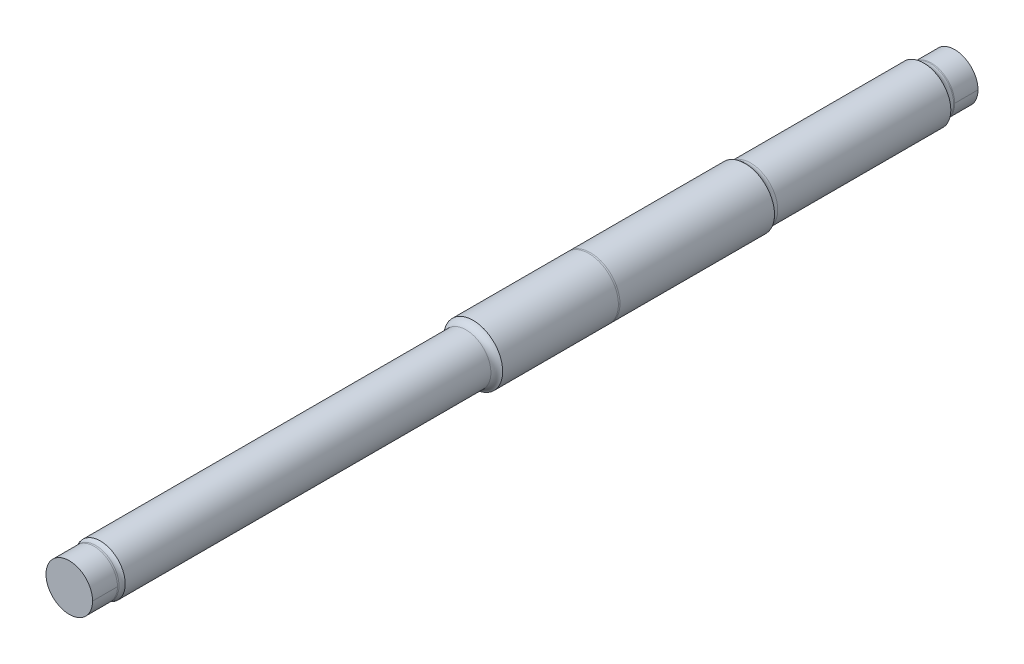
ISO-10303-21;
HEADER;
FILE_DESCRIPTION(('STEP AP214'),'2;1');
FILE_NAME('part.step','',(''),(''),'','','');
FILE_SCHEMA(('AUTOMOTIVE_DESIGN { 1 0 10303 214 1 1 1 1 }'));
ENDSEC;
DATA;
#1=APPLICATION_CONTEXT('core data for automotive mechanical design processes');
#2=APPLICATION_PROTOCOL_DEFINITION('international standard','automotive_design',2000,#1);
#3=PRODUCT_CONTEXT('',#1,'mechanical');
#4=PRODUCT('Part','Part','',(#3));
#5=PRODUCT_RELATED_PRODUCT_CATEGORY('part','',(#4));
#6=PRODUCT_DEFINITION_FORMATION('','',#4);
#7=PRODUCT_DEFINITION_CONTEXT('part definition',#1,'design');
#8=PRODUCT_DEFINITION('design','',#6,#7);
#9=PRODUCT_DEFINITION_SHAPE('','',#8);
#10=(LENGTH_UNIT() NAMED_UNIT(*) SI_UNIT(.MILLI.,.METRE.));
#11=(NAMED_UNIT(*) PLANE_ANGLE_UNIT() SI_UNIT($,.RADIAN.));
#12=(NAMED_UNIT(*) SI_UNIT($,.STERADIAN.) SOLID_ANGLE_UNIT());
#13=UNCERTAINTY_MEASURE_WITH_UNIT(LENGTH_MEASURE(1.E-05),#10,'distance_accuracy_value','');
#14=(GEOMETRIC_REPRESENTATION_CONTEXT(3) GLOBAL_UNCERTAINTY_ASSIGNED_CONTEXT((#13)) GLOBAL_UNIT_ASSIGNED_CONTEXT((#10,
#11,#12)) REPRESENTATION_CONTEXT('',''));
#15=CARTESIAN_POINT('',(0.,0.,0.));
#16=DIRECTION('',(0.,0.,1.));
#17=DIRECTION('',(1.,0.,0.));
#18=AXIS2_PLACEMENT_3D('',#15,#16,#17);
#19=CARTESIAN_POINT('',(0.,0.,-285.));
#20=DIRECTION('',(0.,0.,-1.));
#21=DIRECTION('',(0.,1.,0.));
#22=AXIS2_PLACEMENT_3D('',#19,#20,#21);
#23=CYLINDRICAL_SURFACE('',#22,15.);
#24=CARTESIAN_POINT('',(0.,0.,285.));
#25=DIRECTION('',(0.,0.,-1.));
#26=DIRECTION('',(0.,1.,0.));
#27=AXIS2_PLACEMENT_3D('',#24,#25,#26);
#28=CIRCLE('',#27,15.);
#29=CARTESIAN_POINT('',(15.,0.,285.));
#30=VERTEX_POINT('',#29);
#31=CARTESIAN_POINT('',(-15.,0.,285.));
#32=VERTEX_POINT('',#31);
#33=EDGE_CURVE('E125',#30,#32,#28,.T.);
#34=ORIENTED_EDGE('',*,*,#33,.T.);
#35=DIRECTION('',(0.,0.,-1.));
#36=VECTOR('',#35,1.);
#37=CARTESIAN_POINT('',(-15.,0.,-285.));
#38=LINE('',#37,#36);
#39=CARTESIAN_POINT('',(-15.,0.,269.));
#40=VERTEX_POINT('',#39);
#41=EDGE_CURVE('E12',#32,#40,#38,.T.);
#42=ORIENTED_EDGE('',*,*,#41,.T.);
#43=CARTESIAN_POINT('',(0.,0.,269.));
#44=DIRECTION('',(0.,0.,-1.));
#45=DIRECTION('',(1.,0.,0.));
#46=AXIS2_PLACEMENT_3D('',#43,#44,#45);
#47=CIRCLE('',#46,15.);
#48=CARTESIAN_POINT('',(15.,0.,269.));
#49=VERTEX_POINT('',#48);
#50=EDGE_CURVE('E108',#49,#40,#47,.T.);
#51=ORIENTED_EDGE('',*,*,#50,.F.);
#52=DIRECTION('',(0.,0.,1.));
#53=VECTOR('',#52,1.);
#54=CARTESIAN_POINT('',(15.,0.,-285.));
#55=LINE('',#54,#53);
#56=EDGE_CURVE('E49',#49,#30,#55,.T.);
#57=ORIENTED_EDGE('',*,*,#56,.T.);
#58=EDGE_LOOP('',(#34,#42,#51,#57));
#59=FACE_BOUND('',#58,.T.);
#60=ADVANCED_FACE('F41',(#59),#23,.T.);
#61=CARTESIAN_POINT('',(0.,0.,-285.));
#62=DIRECTION('',(0.,0.,-1.));
#63=DIRECTION('',(0.,1.,0.));
#64=AXIS2_PLACEMENT_3D('',#61,#62,#63);
#65=CYLINDRICAL_SURFACE('',#64,14.9999999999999);
#66=CARTESIAN_POINT('',(0.,0.,-270.));
#67=DIRECTION('',(0.,0.,-1.));
#68=DIRECTION('',(1.,0.,0.));
#69=AXIS2_PLACEMENT_3D('',#66,#67,#68);
#70=CIRCLE('',#69,14.9999999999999);
#71=CARTESIAN_POINT('',(14.9999999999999,0.,-270.));
#72=VERTEX_POINT('',#71);
#73=CARTESIAN_POINT('',(-14.9999999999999,0.,-270.));
#74=VERTEX_POINT('',#73);
#75=EDGE_CURVE('E146',#72,#74,#70,.T.);
#76=ORIENTED_EDGE('',*,*,#75,.T.);
#77=DIRECTION('',(0.,0.,-1.));
#78=VECTOR('',#77,1.);
#79=CARTESIAN_POINT('',(-14.9999999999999,0.,-285.));
#80=LINE('',#79,#78);
#81=CARTESIAN_POINT('',(-14.9999999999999,0.,-285.));
#82=VERTEX_POINT('',#81);
#83=EDGE_CURVE('E121',#74,#82,#80,.T.);
#84=ORIENTED_EDGE('',*,*,#83,.T.);
#85=CARTESIAN_POINT('',(0.,0.,-285.));
#86=DIRECTION('',(0.,0.,-1.));
#87=DIRECTION('',(0.,1.,0.));
#88=AXIS2_PLACEMENT_3D('',#85,#86,#87);
#89=CIRCLE('',#88,14.9999999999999);
#90=CARTESIAN_POINT('',(14.9999999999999,0.,-285.));
#91=VERTEX_POINT('',#90);
#92=EDGE_CURVE('E159',#91,#82,#89,.T.);
#93=ORIENTED_EDGE('',*,*,#92,.F.);
#94=DIRECTION('',(0.,0.,1.));
#95=VECTOR('',#94,1.);
#96=CARTESIAN_POINT('',(14.9999999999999,0.,-285.));
#97=LINE('',#96,#95);
#98=EDGE_CURVE('E118',#91,#72,#97,.T.);
#99=ORIENTED_EDGE('',*,*,#98,.T.);
#100=EDGE_LOOP('',(#76,#84,#93,#99));
#101=FACE_BOUND('',#100,.T.);
#102=ADVANCED_FACE('F157',(#101),#65,.T.);
#103=CARTESIAN_POINT('',(0.,0.,-285.));
#104=DIRECTION('',(0.,0.,-1.));
#105=DIRECTION('',(0.,1.,0.));
#106=AXIS2_PLACEMENT_3D('',#103,#104,#105);
#107=CYLINDRICAL_SURFACE('',#106,19.);
#108=CARTESIAN_POINT('',(0.,0.,-49.5));
#109=DIRECTION('',(0.,0.,-1.));
#110=DIRECTION('',(1.,0.,0.));
#111=AXIS2_PLACEMENT_3D('',#108,#109,#110);
#112=CIRCLE('',#111,19.);
#113=CARTESIAN_POINT('',(19.,0.,-49.5));
#114=VERTEX_POINT('',#113);
#115=CARTESIAN_POINT('',(-19.,0.,-49.5));
#116=VERTEX_POINT('',#115);
#117=EDGE_CURVE('E97',#114,#116,#112,.T.);
#118=ORIENTED_EDGE('',*,*,#117,.T.);
#119=DIRECTION('',(0.,0.,-1.));
#120=VECTOR('',#119,1.);
#121=CARTESIAN_POINT('',(-19.,0.,-285.));
#122=LINE('',#121,#120);
#123=CARTESIAN_POINT('',(-19.,0.,-50.5));
#124=VERTEX_POINT('',#123);
#125=EDGE_CURVE('E107',#116,#124,#122,.T.);
#126=ORIENTED_EDGE('',*,*,#125,.T.);
#127=CARTESIAN_POINT('',(0.,0.,-50.5));
#128=DIRECTION('',(0.,0.,-1.));
#129=DIRECTION('',(1.,0.,0.));
#130=AXIS2_PLACEMENT_3D('',#127,#128,#129);
#131=CIRCLE('',#130,19.);
#132=CARTESIAN_POINT('',(19.,0.,-50.5));
#133=VERTEX_POINT('',#132);
#134=EDGE_CURVE('E95',#133,#124,#131,.T.);
#135=ORIENTED_EDGE('',*,*,#134,.F.);
#136=DIRECTION('',(0.,0.,1.));
#137=VECTOR('',#136,1.);
#138=CARTESIAN_POINT('',(19.,0.,-285.));
#139=LINE('',#138,#137);
#140=EDGE_CURVE('E100',#133,#114,#139,.T.);
#141=ORIENTED_EDGE('',*,*,#140,.T.);
#142=EDGE_LOOP('',(#118,#126,#135,#141));
#143=FACE_BOUND('',#142,.T.);
#144=ADVANCED_FACE('F110',(#143),#107,.T.);
#145=CARTESIAN_POINT('',(0.,0.,268.));
#146=DIRECTION('',(0.,0.,-1.));
#147=DIRECTION('',(0.,1.,0.));
#148=AXIS2_PLACEMENT_3D('',#145,#146,#147);
#149=CIRCLE('',#148,15.);
#150=CARTESIAN_POINT('',(0.,15.,268.));
#151=VERTEX_POINT('',#150);
#152=EDGE_CURVE('E143',#151,#151,#149,.F.);
#153=ORIENTED_EDGE('',*,*,#152,.T.);
#154=EDGE_LOOP('',(#153));
#155=FACE_BOUND('',#154,.T.);
#156=ORIENTED_EDGE('',*,*,#50,.T.);
#157=EDGE_CURVE('E111',#40,#49,#47,.T.);
#158=ORIENTED_EDGE('',*,*,#157,.T.);
#159=EDGE_LOOP('',(#156,#158));
#160=FACE_BOUND('',#159,.T.);
#161=ADVANCED_FACE('F186',(#155,#160),#23,.T.);
#162=CARTESIAN_POINT('',(0.,0.,-150.));
#163=DIRECTION('',(0.,0.,-1.));
#164=DIRECTION('',(0.,1.,0.));
#165=AXIS2_PLACEMENT_3D('',#162,#163,#164);
#166=CIRCLE('',#165,18.9999999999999);
#167=CARTESIAN_POINT('',(0.,19.,-150.));
#168=VERTEX_POINT('',#167);
#169=EDGE_CURVE('E226',#168,#168,#166,.T.);
#170=ORIENTED_EDGE('',*,*,#169,.F.);
#171=EDGE_LOOP('',(#170));
#172=FACE_BOUND('',#171,.T.);
#173=ORIENTED_EDGE('',*,*,#134,.T.);
#174=EDGE_CURVE('E91',#124,#133,#131,.T.);
#175=ORIENTED_EDGE('',*,*,#174,.T.);
#176=EDGE_LOOP('',(#173,#175));
#177=FACE_BOUND('',#176,.T.);
#178=ADVANCED_FACE('F93',(#172,#177),#107,.T.);
#179=ORIENTED_EDGE('',*,*,#125,.F.);
#180=EDGE_CURVE('E103',#116,#114,#112,.T.);
#181=ORIENTED_EDGE('',*,*,#180,.T.);
#182=ORIENTED_EDGE('',*,*,#140,.F.);
#183=ORIENTED_EDGE('',*,*,#174,.F.);
#184=EDGE_LOOP('',(#179,#181,#182,#183));
#185=FACE_BOUND('',#184,.T.);
#186=ADVANCED_FACE('F101',(#185),#107,.T.);
#187=ORIENTED_EDGE('',*,*,#83,.F.);
#188=EDGE_CURVE('E145',#74,#72,#70,.T.);
#189=ORIENTED_EDGE('',*,*,#188,.T.);
#190=ORIENTED_EDGE('',*,*,#98,.F.);
#191=EDGE_CURVE('E233',#82,#91,#89,.T.);
#192=ORIENTED_EDGE('',*,*,#191,.F.);
#193=EDGE_LOOP('',(#187,#189,#190,#192));
#194=FACE_BOUND('',#193,.T.);
#195=ADVANCED_FACE('F153',(#194),#65,.T.);
#196=CARTESIAN_POINT('',(0.,0.,285.));
#197=DIRECTION('',(0.,0.,1.));
#198=DIRECTION('',(0.,-1.,0.));
#199=AXIS2_PLACEMENT_3D('',#196,#197,#198);
#200=PLANE('',#199);
#201=ORIENTED_EDGE('',*,*,#33,.F.);
#202=EDGE_CURVE('E128',#32,#30,#28,.T.);
#203=ORIENTED_EDGE('',*,*,#202,.F.);
#204=EDGE_LOOP('',(#201,#203));
#205=FACE_BOUND('',#204,.T.);
#206=ADVANCED_FACE('F127',(#205),#200,.T.);
#207=ORIENTED_EDGE('',*,*,#41,.F.);
#208=ORIENTED_EDGE('',*,*,#202,.T.);
#209=ORIENTED_EDGE('',*,*,#56,.F.);
#210=ORIENTED_EDGE('',*,*,#157,.F.);
#211=EDGE_LOOP('',(#207,#208,#209,#210));
#212=FACE_BOUND('',#211,.T.);
#213=ADVANCED_FACE('F187',(#212),#23,.T.);
#214=CARTESIAN_POINT('',(0.,0.,-285.));
#215=DIRECTION('',(0.,0.,-1.));
#216=DIRECTION('',(0.,1.,0.));
#217=AXIS2_PLACEMENT_3D('',#214,#215,#216);
#218=CYLINDRICAL_SURFACE('',#217,16.);
#219=CARTESIAN_POINT('',(0.,0.,29.5825756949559));
#220=DIRECTION('',(0.,0.,-1.));
#221=DIRECTION('',(0.,1.,0.));
#222=AXIS2_PLACEMENT_3D('',#219,#220,#221);
#223=CIRCLE('',#222,16.);
#224=CARTESIAN_POINT('',(0.,16.,29.5825756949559));
#225=VERTEX_POINT('',#224);
#226=EDGE_CURVE('E140',#225,#225,#223,.F.);
#227=ORIENTED_EDGE('',*,*,#226,.T.);
#228=EDGE_LOOP('',(#227));
#229=FACE_BOUND('',#228,.T.);
#230=CARTESIAN_POINT('',(0.,0.,265.));
#231=DIRECTION('',(0.,0.,-1.));
#232=DIRECTION('',(0.,1.,0.));
#233=AXIS2_PLACEMENT_3D('',#230,#231,#232);
#234=CIRCLE('',#233,16.);
#235=CARTESIAN_POINT('',(0.,16.,265.));
#236=VERTEX_POINT('',#235);
#237=EDGE_CURVE('E134',#236,#236,#234,.T.);
#238=ORIENTED_EDGE('',*,*,#237,.T.);
#239=EDGE_LOOP('',(#238));
#240=FACE_BOUND('',#239,.T.);
#241=ADVANCED_FACE('F195',(#229,#240),#218,.T.);
#242=ORIENTED_EDGE('',*,*,#117,.F.);
#243=ORIENTED_EDGE('',*,*,#180,.F.);
#244=EDGE_LOOP('',(#242,#243));
#245=FACE_BOUND('',#244,.T.);
#246=CARTESIAN_POINT('',(0.,0.,25.));
#247=DIRECTION('',(0.,0.,-1.));
#248=DIRECTION('',(0.,1.,0.));
#249=AXIS2_PLACEMENT_3D('',#246,#247,#248);
#250=CIRCLE('',#249,19.);
#251=CARTESIAN_POINT('',(0.,19.,25.));
#252=VERTEX_POINT('',#251);
#253=EDGE_CURVE('E227',#252,#252,#250,.T.);
#254=ORIENTED_EDGE('',*,*,#253,.T.);
#255=EDGE_LOOP('',(#254));
#256=FACE_BOUND('',#255,.T.);
#257=ADVANCED_FACE('F200',(#245,#256),#107,.T.);
#258=CARTESIAN_POINT('',(0.,0.,-285.));
#259=DIRECTION('',(0.,0.,-1.));
#260=DIRECTION('',(0.,1.,0.));
#261=AXIS2_PLACEMENT_3D('',#258,#259,#260);
#262=CYLINDRICAL_SURFACE('',#261,17.5);
#263=CARTESIAN_POINT('',(0.,0.,-153.570714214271));
#264=DIRECTION('',(0.,0.,1.));
#265=DIRECTION('',(0.,-1.,0.));
#266=AXIS2_PLACEMENT_3D('',#263,#264,#265);
#267=CIRCLE('',#266,17.5);
#268=CARTESIAN_POINT('',(0.,-17.4999999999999,-153.570714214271));
#269=VERTEX_POINT('',#268);
#270=EDGE_CURVE('E132',#269,#269,#267,.F.);
#271=ORIENTED_EDGE('',*,*,#270,.T.);
#272=EDGE_LOOP('',(#271));
#273=FACE_BOUND('',#272,.T.);
#274=CARTESIAN_POINT('',(0.,0.,-265.));
#275=DIRECTION('',(0.,0.,-1.));
#276=DIRECTION('',(0.,1.,0.));
#277=AXIS2_PLACEMENT_3D('',#274,#275,#276);
#278=CIRCLE('',#277,17.5);
#279=CARTESIAN_POINT('',(0.,17.5,-265.));
#280=VERTEX_POINT('',#279);
#281=EDGE_CURVE('E228',#280,#280,#278,.T.);
#282=ORIENTED_EDGE('',*,*,#281,.F.);
#283=EDGE_LOOP('',(#282));
#284=FACE_BOUND('',#283,.T.);
#285=ADVANCED_FACE('F164',(#273,#284),#262,.T.);
#286=ORIENTED_EDGE('',*,*,#75,.F.);
#287=ORIENTED_EDGE('',*,*,#188,.F.);
#288=EDGE_LOOP('',(#286,#287));
#289=FACE_BOUND('',#288,.T.);
#290=CARTESIAN_POINT('',(0.,0.,-269.330127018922));
#291=DIRECTION('',(0.,0.,1.));
#292=DIRECTION('',(0.,-1.,0.));
#293=AXIS2_PLACEMENT_3D('',#290,#291,#292);
#294=CIRCLE('',#293,14.9999999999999);
#295=CARTESIAN_POINT('',(0.,-14.9999999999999,-269.330127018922));
#296=VERTEX_POINT('',#295);
#297=EDGE_CURVE('E129',#296,#296,#294,.F.);
#298=ORIENTED_EDGE('',*,*,#297,.T.);
#299=EDGE_LOOP('',(#298));
#300=FACE_BOUND('',#299,.T.);
#301=ADVANCED_FACE('F160',(#289,#300),#65,.T.);
#302=CARTESIAN_POINT('',(0.,15.,-285.));
#303=DIRECTION('',(0.,0.,-1.));
#304=DIRECTION('',(0.,1.,0.));
#305=AXIS2_PLACEMENT_3D('',#302,#303,#304);
#306=PLANE('',#305);
#307=ORIENTED_EDGE('',*,*,#92,.T.);
#308=ORIENTED_EDGE('',*,*,#191,.T.);
#309=EDGE_LOOP('',(#307,#308));
#310=FACE_BOUND('',#309,.T.);
#311=ADVANCED_FACE('F163',(#310),#306,.T.);
#312=CARTESIAN_POINT('',(0.,0.,-269.330127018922));
#313=DIRECTION('',(0.,0.,1.));
#314=DIRECTION('',(0.,-1.,0.));
#315=AXIS2_PLACEMENT_3D('',#312,#313,#314);
#316=TOROIDAL_SURFACE('',#315,19.9999999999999,5.);
#317=ORIENTED_EDGE('',*,*,#281,.T.);
#318=EDGE_LOOP('',(#317));
#319=FACE_BOUND('',#318,.T.);
#320=ORIENTED_EDGE('',*,*,#297,.F.);
#321=EDGE_LOOP('',(#320));
#322=FACE_BOUND('',#321,.T.);
#323=ADVANCED_FACE('F168',(#319,#322),#316,.F.);
#324=CARTESIAN_POINT('',(0.,0.,-153.570714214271));
#325=DIRECTION('',(0.,0.,1.));
#326=DIRECTION('',(0.,-1.,0.));
#327=AXIS2_PLACEMENT_3D('',#324,#325,#326);
#328=TOROIDAL_SURFACE('',#327,22.5,5.);
#329=ORIENTED_EDGE('',*,*,#169,.T.);
#330=EDGE_LOOP('',(#329));
#331=FACE_BOUND('',#330,.T.);
#332=ORIENTED_EDGE('',*,*,#270,.F.);
#333=EDGE_LOOP('',(#332));
#334=FACE_BOUND('',#333,.T.);
#335=ADVANCED_FACE('F170',(#331,#334),#328,.F.);
#336=CARTESIAN_POINT('',(0.,0.,29.5825756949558));
#337=DIRECTION('',(0.,0.,-1.));
#338=DIRECTION('',(0.,1.,0.));
#339=AXIS2_PLACEMENT_3D('',#336,#337,#338);
#340=TOROIDAL_SURFACE('',#339,21.,5.);
#341=ORIENTED_EDGE('',*,*,#226,.F.);
#342=EDGE_LOOP('',(#341));
#343=FACE_BOUND('',#342,.T.);
#344=ORIENTED_EDGE('',*,*,#253,.F.);
#345=EDGE_LOOP('',(#344));
#346=FACE_BOUND('',#345,.T.);
#347=ADVANCED_FACE('F177',(#343,#346),#340,.F.);
#348=CARTESIAN_POINT('',(0.,0.,268.));
#349=DIRECTION('',(0.,0.,-1.));
#350=DIRECTION('',(0.,1.,0.));
#351=AXIS2_PLACEMENT_3D('',#348,#349,#350);
#352=TOROIDAL_SURFACE('',#351,20.,5.);
#353=ORIENTED_EDGE('',*,*,#152,.F.);
#354=EDGE_LOOP('',(#353));
#355=FACE_BOUND('',#354,.T.);
#356=ORIENTED_EDGE('',*,*,#237,.F.);
#357=EDGE_LOOP('',(#356));
#358=FACE_BOUND('',#357,.T.);
#359=ADVANCED_FACE('F43',(#355,#358),#352,.F.);
#360=CLOSED_SHELL('',(#60,#102,#144,#161,#178,#186,#195,#206,#213,#241,#257,#285,#301,#311,#323,
#335,#347,#359));
#361=MANIFOLD_SOLID_BREP('B2',#360);
#362=ADVANCED_BREP_SHAPE_REPRESENTATION('',(#18,#361),#14);
#363=SHAPE_DEFINITION_REPRESENTATION(#9,#362);
ENDSEC;
END-ISO-10303-21;
